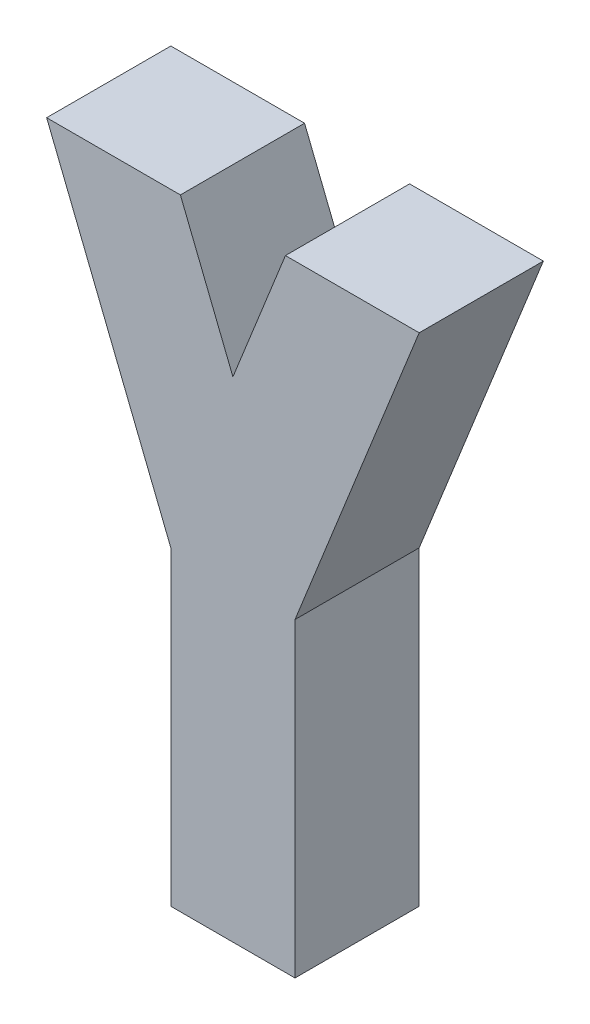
ISO-10303-21;
HEADER;
FILE_DESCRIPTION(('STEP AP214'),'2;1');
FILE_NAME('part.step','',(''),(''),'','','');
FILE_SCHEMA(('AUTOMOTIVE_DESIGN { 1 0 10303 214 1 1 1 1 }'));
ENDSEC;
DATA;
#1=APPLICATION_CONTEXT('core data for automotive mechanical design processes');
#2=APPLICATION_PROTOCOL_DEFINITION('international standard','automotive_design',2000,#1);
#3=PRODUCT_CONTEXT('',#1,'mechanical');
#4=PRODUCT('Part','Part','',(#3));
#5=PRODUCT_RELATED_PRODUCT_CATEGORY('part','',(#4));
#6=PRODUCT_DEFINITION_FORMATION('','',#4);
#7=PRODUCT_DEFINITION_CONTEXT('part definition',#1,'design');
#8=PRODUCT_DEFINITION('design','',#6,#7);
#9=PRODUCT_DEFINITION_SHAPE('','',#8);
#10=(LENGTH_UNIT() NAMED_UNIT(*) SI_UNIT(.MILLI.,.METRE.));
#11=(NAMED_UNIT(*) PLANE_ANGLE_UNIT() SI_UNIT($,.RADIAN.));
#12=(NAMED_UNIT(*) SI_UNIT($,.STERADIAN.) SOLID_ANGLE_UNIT());
#13=UNCERTAINTY_MEASURE_WITH_UNIT(LENGTH_MEASURE(1.E-05),#10,'distance_accuracy_value','');
#14=(GEOMETRIC_REPRESENTATION_CONTEXT(3) GLOBAL_UNCERTAINTY_ASSIGNED_CONTEXT((#13)) GLOBAL_UNIT_ASSIGNED_CONTEXT((#10,
#11,#12)) REPRESENTATION_CONTEXT('',''));
#15=CARTESIAN_POINT('',(0.,0.,0.));
#16=DIRECTION('',(0.,0.,1.));
#17=DIRECTION('',(1.,0.,0.));
#18=AXIS2_PLACEMENT_3D('',#15,#16,#17);
#19=CARTESIAN_POINT('',(19.229670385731,50.,10.));
#20=DIRECTION('',(0.,-1.,0.));
#21=DIRECTION('',(0.,0.,-1.));
#22=AXIS2_PLACEMENT_3D('',#19,#20,#21);
#23=PLANE('',#22);
#24=DIRECTION('',(-1.,0.,0.));
#25=VECTOR('',#24,1.);
#26=CARTESIAN_POINT('',(19.229670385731,50.,0.));
#27=LINE('',#26,#25);
#28=CARTESIAN_POINT('',(30.,50.,0.));
#29=VERTEX_POINT('',#28);
#30=CARTESIAN_POINT('',(19.229670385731,50.,0.));
#31=VERTEX_POINT('',#30);
#32=EDGE_CURVE('E135',#29,#31,#27,.T.);
#33=ORIENTED_EDGE('',*,*,#32,.T.);
#34=DIRECTION('',(0.,0.,-1.));
#35=VECTOR('',#34,1.);
#36=CARTESIAN_POINT('',(19.229670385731,50.,10.));
#37=LINE('',#36,#35);
#38=CARTESIAN_POINT('',(19.229670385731,50.,10.));
#39=VERTEX_POINT('',#38);
#40=EDGE_CURVE('E11',#39,#31,#37,.T.);
#41=ORIENTED_EDGE('',*,*,#40,.F.);
#42=DIRECTION('',(-1.,0.,0.));
#43=VECTOR('',#42,1.);
#44=CARTESIAN_POINT('',(19.229670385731,50.,10.));
#45=LINE('',#44,#43);
#46=CARTESIAN_POINT('',(30.,50.,10.));
#47=VERTEX_POINT('',#46);
#48=EDGE_CURVE('E151',#47,#39,#45,.T.);
#49=ORIENTED_EDGE('',*,*,#48,.F.);
#50=DIRECTION('',(0.,0.,-1.));
#51=VECTOR('',#50,1.);
#52=CARTESIAN_POINT('',(30.,50.,10.));
#53=LINE('',#52,#51);
#54=EDGE_CURVE('E131',#47,#29,#53,.T.);
#55=ORIENTED_EDGE('',*,*,#54,.T.);
#56=EDGE_LOOP('',(#33,#41,#49,#55));
#57=FACE_BOUND('',#56,.T.);
#58=ADVANCED_FACE('F33',(#57),#23,.F.);
#59=CARTESIAN_POINT('',(19.229670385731,50.,10.));
#60=DIRECTION('',(0.928476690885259,-0.371390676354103,0.));
#61=DIRECTION('',(0.371390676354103,0.928476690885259,0.));
#62=AXIS2_PLACEMENT_3D('',#59,#60,#61);
#63=PLANE('',#62);
#64=DIRECTION('',(-0.371390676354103,-0.928476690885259,0.));
#65=VECTOR('',#64,1.);
#66=CARTESIAN_POINT('',(19.229670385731,50.,0.));
#67=LINE('',#66,#65);
#68=CARTESIAN_POINT('',(15.,39.4258240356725,0.));
#69=VERTEX_POINT('',#68);
#70=EDGE_CURVE('E138',#31,#69,#67,.T.);
#71=ORIENTED_EDGE('',*,*,#70,.T.);
#72=DIRECTION('',(0.,0.,-1.));
#73=VECTOR('',#72,1.);
#74=CARTESIAN_POINT('',(15.,39.4258240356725,10.));
#75=LINE('',#74,#73);
#76=CARTESIAN_POINT('',(15.,39.4258240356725,10.));
#77=VERTEX_POINT('',#76);
#78=EDGE_CURVE('E41',#77,#69,#75,.T.);
#79=ORIENTED_EDGE('',*,*,#78,.F.);
#80=DIRECTION('',(-0.371390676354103,-0.928476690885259,0.));
#81=VECTOR('',#80,1.);
#82=CARTESIAN_POINT('',(19.229670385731,50.,10.));
#83=LINE('',#82,#81);
#84=EDGE_CURVE('E95',#39,#77,#83,.T.);
#85=ORIENTED_EDGE('',*,*,#84,.F.);
#86=ORIENTED_EDGE('',*,*,#40,.T.);
#87=EDGE_LOOP('',(#71,#79,#85,#86));
#88=FACE_BOUND('',#87,.T.);
#89=ADVANCED_FACE('F194',(#88),#63,.F.);
#90=CARTESIAN_POINT('',(10.770329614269,50.,10.));
#91=DIRECTION('',(-0.928476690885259,-0.371390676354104,0.));
#92=DIRECTION('',(0.371390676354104,-0.928476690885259,0.));
#93=AXIS2_PLACEMENT_3D('',#90,#91,#92);
#94=PLANE('',#93);
#95=DIRECTION('',(-0.371390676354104,0.928476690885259,0.));
#96=VECTOR('',#95,1.);
#97=CARTESIAN_POINT('',(10.770329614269,50.,0.));
#98=LINE('',#97,#96);
#99=CARTESIAN_POINT('',(10.770329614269,50.,0.));
#100=VERTEX_POINT('',#99);
#101=EDGE_CURVE('E140',#69,#100,#98,.T.);
#102=ORIENTED_EDGE('',*,*,#101,.T.);
#103=DIRECTION('',(0.,0.,-1.));
#104=VECTOR('',#103,1.);
#105=CARTESIAN_POINT('',(10.770329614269,50.,10.));
#106=LINE('',#105,#104);
#107=CARTESIAN_POINT('',(10.770329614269,50.,10.));
#108=VERTEX_POINT('',#107);
#109=EDGE_CURVE('E161',#108,#100,#106,.T.);
#110=ORIENTED_EDGE('',*,*,#109,.F.);
#111=DIRECTION('',(-0.371390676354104,0.928476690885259,0.));
#112=VECTOR('',#111,1.);
#113=CARTESIAN_POINT('',(10.770329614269,50.,10.));
#114=LINE('',#113,#112);
#115=EDGE_CURVE('E169',#77,#108,#114,.T.);
#116=ORIENTED_EDGE('',*,*,#115,.F.);
#117=ORIENTED_EDGE('',*,*,#78,.T.);
#118=EDGE_LOOP('',(#102,#110,#116,#117));
#119=FACE_BOUND('',#118,.T.);
#120=ADVANCED_FACE('F167',(#119),#94,.F.);
#121=CARTESIAN_POINT('',(0.,50.,10.));
#122=DIRECTION('',(0.,-1.,0.));
#123=DIRECTION('',(0.,0.,-1.));
#124=AXIS2_PLACEMENT_3D('',#121,#122,#123);
#125=PLANE('',#124);
#126=DIRECTION('',(-1.,0.,0.));
#127=VECTOR('',#126,1.);
#128=CARTESIAN_POINT('',(0.,50.,0.));
#129=LINE('',#128,#127);
#130=CARTESIAN_POINT('',(0.,50.,0.));
#131=VERTEX_POINT('',#130);
#132=EDGE_CURVE('E142',#100,#131,#129,.T.);
#133=ORIENTED_EDGE('',*,*,#132,.T.);
#134=DIRECTION('',(0.,0.,-1.));
#135=VECTOR('',#134,1.);
#136=CARTESIAN_POINT('',(0.,50.,10.));
#137=LINE('',#136,#135);
#138=CARTESIAN_POINT('',(0.,50.,10.));
#139=VERTEX_POINT('',#138);
#140=EDGE_CURVE('E158',#139,#131,#137,.T.);
#141=ORIENTED_EDGE('',*,*,#140,.F.);
#142=DIRECTION('',(-1.,0.,0.));
#143=VECTOR('',#142,1.);
#144=CARTESIAN_POINT('',(0.,50.,10.));
#145=LINE('',#144,#143);
#146=EDGE_CURVE('E185',#108,#139,#145,.T.);
#147=ORIENTED_EDGE('',*,*,#146,.F.);
#148=ORIENTED_EDGE('',*,*,#109,.T.);
#149=EDGE_LOOP('',(#133,#141,#147,#148));
#150=FACE_BOUND('',#149,.T.);
#151=ADVANCED_FACE('F178',(#150),#125,.F.);
#152=CARTESIAN_POINT('',(10.,25.,10.));
#153=DIRECTION('',(0.928476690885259,0.371390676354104,0.));
#154=DIRECTION('',(-0.371390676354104,0.928476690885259,0.));
#155=AXIS2_PLACEMENT_3D('',#152,#153,#154);
#156=PLANE('',#155);
#157=DIRECTION('',(0.371390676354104,-0.928476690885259,0.));
#158=VECTOR('',#157,1.);
#159=CARTESIAN_POINT('',(10.,25.,0.));
#160=LINE('',#159,#158);
#161=CARTESIAN_POINT('',(10.,25.,0.));
#162=VERTEX_POINT('',#161);
#163=EDGE_CURVE('E144',#131,#162,#160,.T.);
#164=ORIENTED_EDGE('',*,*,#163,.T.);
#165=DIRECTION('',(0.,0.,-1.));
#166=VECTOR('',#165,1.);
#167=CARTESIAN_POINT('',(10.,25.,10.));
#168=LINE('',#167,#166);
#169=CARTESIAN_POINT('',(10.,25.,10.));
#170=VERTEX_POINT('',#169);
#171=EDGE_CURVE('E155',#170,#162,#168,.T.);
#172=ORIENTED_EDGE('',*,*,#171,.F.);
#173=DIRECTION('',(0.371390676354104,-0.928476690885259,0.));
#174=VECTOR('',#173,1.);
#175=CARTESIAN_POINT('',(10.,25.,10.));
#176=LINE('',#175,#174);
#177=EDGE_CURVE('E184',#139,#170,#176,.T.);
#178=ORIENTED_EDGE('',*,*,#177,.F.);
#179=ORIENTED_EDGE('',*,*,#140,.T.);
#180=EDGE_LOOP('',(#164,#172,#178,#179));
#181=FACE_BOUND('',#180,.T.);
#182=ADVANCED_FACE('F182',(#181),#156,.F.);
#183=CARTESIAN_POINT('',(10.,0.,10.));
#184=DIRECTION('',(1.,0.,0.));
#185=DIRECTION('',(0.,0.,-1.));
#186=AXIS2_PLACEMENT_3D('',#183,#184,#185);
#187=PLANE('',#186);
#188=DIRECTION('',(0.,-1.,0.));
#189=VECTOR('',#188,1.);
#190=CARTESIAN_POINT('',(10.,0.,0.));
#191=LINE('',#190,#189);
#192=CARTESIAN_POINT('',(10.,0.,0.));
#193=VERTEX_POINT('',#192);
#194=EDGE_CURVE('E146',#162,#193,#191,.T.);
#195=ORIENTED_EDGE('',*,*,#194,.T.);
#196=DIRECTION('',(0.,0.,-1.));
#197=VECTOR('',#196,1.);
#198=CARTESIAN_POINT('',(10.,0.,10.));
#199=LINE('',#198,#197);
#200=CARTESIAN_POINT('',(10.,0.,10.));
#201=VERTEX_POINT('',#200);
#202=EDGE_CURVE('E126',#201,#193,#199,.T.);
#203=ORIENTED_EDGE('',*,*,#202,.F.);
#204=DIRECTION('',(0.,-1.,0.));
#205=VECTOR('',#204,1.);
#206=CARTESIAN_POINT('',(10.,0.,10.));
#207=LINE('',#206,#205);
#208=EDGE_CURVE('E117',#170,#201,#207,.T.);
#209=ORIENTED_EDGE('',*,*,#208,.F.);
#210=ORIENTED_EDGE('',*,*,#171,.T.);
#211=EDGE_LOOP('',(#195,#203,#209,#210));
#212=FACE_BOUND('',#211,.T.);
#213=ADVANCED_FACE('F206',(#212),#187,.F.);
#214=CARTESIAN_POINT('',(10.,0.,10.));
#215=DIRECTION('',(0.,1.,0.));
#216=DIRECTION('',(0.,0.,1.));
#217=AXIS2_PLACEMENT_3D('',#214,#215,#216);
#218=PLANE('',#217);
#219=DIRECTION('',(1.,0.,0.));
#220=VECTOR('',#219,1.);
#221=CARTESIAN_POINT('',(10.,0.,0.));
#222=LINE('',#221,#220);
#223=CARTESIAN_POINT('',(20.,0.,0.));
#224=VERTEX_POINT('',#223);
#225=EDGE_CURVE('E125',#193,#224,#222,.T.);
#226=ORIENTED_EDGE('',*,*,#225,.T.);
#227=DIRECTION('',(0.,0.,-1.));
#228=VECTOR('',#227,1.);
#229=CARTESIAN_POINT('',(20.,0.,10.));
#230=LINE('',#229,#228);
#231=CARTESIAN_POINT('',(20.,0.,10.));
#232=VERTEX_POINT('',#231);
#233=EDGE_CURVE('E122',#232,#224,#230,.T.);
#234=ORIENTED_EDGE('',*,*,#233,.F.);
#235=DIRECTION('',(1.,0.,0.));
#236=VECTOR('',#235,1.);
#237=CARTESIAN_POINT('',(10.,0.,10.));
#238=LINE('',#237,#236);
#239=EDGE_CURVE('E111',#201,#232,#238,.T.);
#240=ORIENTED_EDGE('',*,*,#239,.F.);
#241=ORIENTED_EDGE('',*,*,#202,.T.);
#242=EDGE_LOOP('',(#226,#234,#240,#241));
#243=FACE_BOUND('',#242,.T.);
#244=ADVANCED_FACE('F123',(#243),#218,.F.);
#245=CARTESIAN_POINT('',(20.,0.,10.));
#246=DIRECTION('',(-1.,0.,0.));
#247=DIRECTION('',(0.,0.,1.));
#248=AXIS2_PLACEMENT_3D('',#245,#246,#247);
#249=PLANE('',#248);
#250=DIRECTION('',(0.,1.,0.));
#251=VECTOR('',#250,1.);
#252=CARTESIAN_POINT('',(20.,0.,0.));
#253=LINE('',#252,#251);
#254=CARTESIAN_POINT('',(20.,25.,0.));
#255=VERTEX_POINT('',#254);
#256=EDGE_CURVE('E81',#224,#255,#253,.T.);
#257=ORIENTED_EDGE('',*,*,#256,.T.);
#258=DIRECTION('',(0.,0.,-1.));
#259=VECTOR('',#258,1.);
#260=CARTESIAN_POINT('',(20.,25.,10.));
#261=LINE('',#260,#259);
#262=CARTESIAN_POINT('',(20.,25.,10.));
#263=VERTEX_POINT('',#262);
#264=EDGE_CURVE('E127',#263,#255,#261,.T.);
#265=ORIENTED_EDGE('',*,*,#264,.F.);
#266=DIRECTION('',(0.,1.,0.));
#267=VECTOR('',#266,1.);
#268=CARTESIAN_POINT('',(20.,0.,10.));
#269=LINE('',#268,#267);
#270=EDGE_CURVE('E115',#232,#263,#269,.T.);
#271=ORIENTED_EDGE('',*,*,#270,.F.);
#272=ORIENTED_EDGE('',*,*,#233,.T.);
#273=EDGE_LOOP('',(#257,#265,#271,#272));
#274=FACE_BOUND('',#273,.T.);
#275=ADVANCED_FACE('F129',(#274),#249,.F.);
#276=CARTESIAN_POINT('',(20.,25.,10.));
#277=DIRECTION('',(-0.928476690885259,0.371390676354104,0.));
#278=DIRECTION('',(-0.371390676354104,-0.928476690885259,0.));
#279=AXIS2_PLACEMENT_3D('',#276,#277,#278);
#280=PLANE('',#279);
#281=DIRECTION('',(0.371390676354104,0.928476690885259,0.));
#282=VECTOR('',#281,1.);
#283=CARTESIAN_POINT('',(20.,25.,0.));
#284=LINE('',#283,#282);
#285=EDGE_CURVE('E87',#255,#29,#284,.T.);
#286=ORIENTED_EDGE('',*,*,#285,.T.);
#287=ORIENTED_EDGE('',*,*,#54,.F.);
#288=DIRECTION('',(0.371390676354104,0.928476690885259,0.));
#289=VECTOR('',#288,1.);
#290=CARTESIAN_POINT('',(20.,25.,10.));
#291=LINE('',#290,#289);
#292=EDGE_CURVE('E49',#263,#47,#291,.T.);
#293=ORIENTED_EDGE('',*,*,#292,.F.);
#294=ORIENTED_EDGE('',*,*,#264,.T.);
#295=EDGE_LOOP('',(#286,#287,#293,#294));
#296=FACE_BOUND('',#295,.T.);
#297=ADVANCED_FACE('F214',(#296),#280,.F.);
#298=CARTESIAN_POINT('',(0.,0.,10.));
#299=DIRECTION('',(0.,0.,1.));
#300=DIRECTION('',(1.,0.,0.));
#301=AXIS2_PLACEMENT_3D('',#298,#299,#300);
#302=PLANE('',#301);
#303=ORIENTED_EDGE('',*,*,#48,.T.);
#304=ORIENTED_EDGE('',*,*,#84,.T.);
#305=ORIENTED_EDGE('',*,*,#115,.T.);
#306=ORIENTED_EDGE('',*,*,#146,.T.);
#307=ORIENTED_EDGE('',*,*,#177,.T.);
#308=ORIENTED_EDGE('',*,*,#208,.T.);
#309=ORIENTED_EDGE('',*,*,#239,.T.);
#310=ORIENTED_EDGE('',*,*,#270,.T.);
#311=ORIENTED_EDGE('',*,*,#292,.T.);
#312=EDGE_LOOP('',(#303,#304,#305,#306,#307,#308,#309,#310,#311));
#313=FACE_BOUND('',#312,.T.);
#314=ADVANCED_FACE('F113',(#313),#302,.T.);
#315=CARTESIAN_POINT('',(0.,0.,0.));
#316=DIRECTION('',(0.,0.,1.));
#317=DIRECTION('',(1.,0.,0.));
#318=AXIS2_PLACEMENT_3D('',#315,#316,#317);
#319=PLANE('',#318);
#320=ORIENTED_EDGE('',*,*,#32,.F.);
#321=ORIENTED_EDGE('',*,*,#285,.F.);
#322=ORIENTED_EDGE('',*,*,#256,.F.);
#323=ORIENTED_EDGE('',*,*,#225,.F.);
#324=ORIENTED_EDGE('',*,*,#194,.F.);
#325=ORIENTED_EDGE('',*,*,#163,.F.);
#326=ORIENTED_EDGE('',*,*,#132,.F.);
#327=ORIENTED_EDGE('',*,*,#101,.F.);
#328=ORIENTED_EDGE('',*,*,#70,.F.);
#329=EDGE_LOOP('',(#320,#321,#322,#323,#324,#325,#326,#327,#328));
#330=FACE_BOUND('',#329,.T.);
#331=ADVANCED_FACE('F173',(#330),#319,.F.);
#332=CLOSED_SHELL('',(#58,#89,#120,#151,#182,#213,#244,#275,#297,#314,#331));
#333=MANIFOLD_SOLID_BREP('B2',#332);
#334=ADVANCED_BREP_SHAPE_REPRESENTATION('',(#18,#333),#14);
#335=SHAPE_DEFINITION_REPRESENTATION(#9,#334);
ENDSEC;
END-ISO-10303-21;
